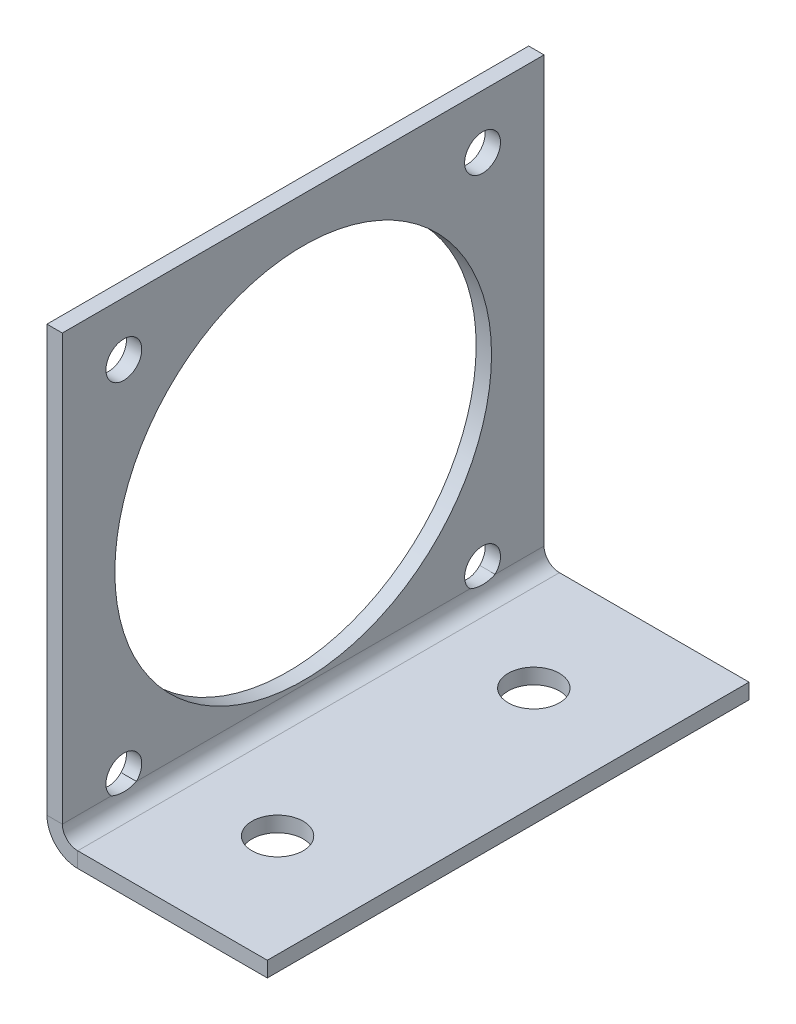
ISO-10303-21;
HEADER;
FILE_DESCRIPTION(('STEP AP214'),'2;1');
FILE_NAME('part.step','',(''),(''),'','','');
FILE_SCHEMA(('AUTOMOTIVE_DESIGN { 1 0 10303 214 1 1 1 1 }'));
ENDSEC;
DATA;
#1=APPLICATION_CONTEXT('core data for automotive mechanical design processes');
#2=APPLICATION_PROTOCOL_DEFINITION('international standard','automotive_design',2000,#1);
#3=PRODUCT_CONTEXT('',#1,'mechanical');
#4=PRODUCT('Part','Part','',(#3));
#5=PRODUCT_RELATED_PRODUCT_CATEGORY('part','',(#4));
#6=PRODUCT_DEFINITION_FORMATION('','',#4);
#7=PRODUCT_DEFINITION_CONTEXT('part definition',#1,'design');
#8=PRODUCT_DEFINITION('design','',#6,#7);
#9=PRODUCT_DEFINITION_SHAPE('','',#8);
#10=(LENGTH_UNIT() NAMED_UNIT(*) SI_UNIT(.MILLI.,.METRE.));
#11=(NAMED_UNIT(*) PLANE_ANGLE_UNIT() SI_UNIT($,.RADIAN.));
#12=(NAMED_UNIT(*) SI_UNIT($,.STERADIAN.) SOLID_ANGLE_UNIT());
#13=UNCERTAINTY_MEASURE_WITH_UNIT(LENGTH_MEASURE(1.E-05),#10,'distance_accuracy_value','');
#14=(GEOMETRIC_REPRESENTATION_CONTEXT(3) GLOBAL_UNCERTAINTY_ASSIGNED_CONTEXT((#13)) GLOBAL_UNIT_ASSIGNED_CONTEXT((#10,
#11,#12)) REPRESENTATION_CONTEXT('',''));
#15=CARTESIAN_POINT('',(0.,0.,0.));
#16=DIRECTION('',(0.,0.,1.));
#17=DIRECTION('',(1.,0.,0.));
#18=AXIS2_PLACEMENT_3D('',#15,#16,#17);
#19=CARTESIAN_POINT('',(3.,3.,94.));
#20=DIRECTION('',(0.,0.,-1.));
#21=DIRECTION('',(-1.,0.,0.));
#22=AXIS2_PLACEMENT_3D('',#19,#20,#21);
#23=CYLINDRICAL_SURFACE('',#22,3.);
#24=DIRECTION('',(0.,0.,-1.));
#25=VECTOR('',#24,1.);
#26=CARTESIAN_POINT('',(0.,3.,94.));
#27=LINE('',#26,#25);
#28=CARTESIAN_POINT('',(0.,3.,79.5505102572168));
#29=VERTEX_POINT('',#28);
#30=CARTESIAN_POINT('',(0.,3.,14.4494897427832));
#31=VERTEX_POINT('',#30);
#32=EDGE_CURVE('E145',#29,#31,#27,.T.);
#33=ORIENTED_EDGE('',*,*,#32,.F.);
#34=CARTESIAN_POINT('',(0.,3.,84.4494897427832));
#35=CARTESIAN_POINT('',(1.47979331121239E-06,2.98249898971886,84.4137569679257));
#36=CARTESIAN_POINT('',(0.000153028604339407,2.96562146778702,84.3777256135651));
#37=CARTESIAN_POINT('',(0.000702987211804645,2.93303032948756,84.3051495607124));
#38=CARTESIAN_POINT('',(0.00110135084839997,2.91731649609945,84.2686049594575));
#39=CARTESIAN_POINT('',(0.00258467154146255,2.8718541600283,84.1584705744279));
#40=CARTESIAN_POINT('',(0.00395834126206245,2.84370762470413,84.0842203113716));
#41=CARTESIAN_POINT('',(0.00715653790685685,2.79125126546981,83.9344449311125));
#42=CARTESIAN_POINT('',(0.00898082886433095,2.76693944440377,83.8589205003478));
#43=CARTESIAN_POINT('',(0.0128433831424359,2.72177370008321,83.7066410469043));
#44=CARTESIAN_POINT('',(0.0148821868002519,2.70092886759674,83.6298833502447));
#45=CARTESIAN_POINT('',(0.0189730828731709,2.66258306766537,83.4754946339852));
#46=CARTESIAN_POINT('',(0.0210251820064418,2.64508395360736,83.3978631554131));
#47=CARTESIAN_POINT('',(0.0249807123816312,2.6133270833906,83.2419102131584));
#48=CARTESIAN_POINT('',(0.0268840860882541,2.59907057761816,83.1635884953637));
#49=CARTESIAN_POINT('',(0.0314851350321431,2.56601293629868,82.9600642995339));
#50=CARTESIAN_POINT('',(0.0339883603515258,2.549497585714,82.8344823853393));
#51=CARTESIAN_POINT('',(0.0380592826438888,2.52347444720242,82.5825721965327));
#52=CARTESIAN_POINT('',(0.0396268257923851,2.51396781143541,82.4562438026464));
#53=CARTESIAN_POINT('',(0.0416374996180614,2.50187365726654,82.203218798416));
#54=CARTESIAN_POINT('',(0.042080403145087,2.49928753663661,82.0765221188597));
#55=CARTESIAN_POINT('',(0.0417783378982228,2.50107622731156,81.8232267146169));
#56=CARTESIAN_POINT('',(0.0410338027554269,2.5054484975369,81.6966279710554));
#57=CARTESIAN_POINT('',(0.0384617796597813,2.52108992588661,81.4438948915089));
#58=CARTESIAN_POINT('',(0.0366345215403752,2.53235762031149,81.3177604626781));
#59=CARTESIAN_POINT('',(0.0320847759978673,2.56215398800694,81.0663767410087));
#60=CARTESIAN_POINT('',(0.0293624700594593,2.58068118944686,80.9411272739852));
#61=CARTESIAN_POINT('',(0.0246293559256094,2.61615041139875,80.7437302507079));
#62=CARTESIAN_POINT('',(0.0227921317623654,2.63055937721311,80.6711167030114));
#63=CARTESIAN_POINT('',(0.0190394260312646,2.66217206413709,80.526525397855));
#64=CARTESIAN_POINT('',(0.017123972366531,2.67937479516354,80.4545474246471));
#65=CARTESIAN_POINT('',(0.01335031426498,2.71666928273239,80.3113813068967));
#66=CARTESIAN_POINT('',(0.0114920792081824,2.73675946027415,80.2401927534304));
#67=CARTESIAN_POINT('',(0.00799354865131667,2.78007612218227,80.0989137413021));
#68=CARTESIAN_POINT('',(0.00635284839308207,2.80329661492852,80.0288214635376));
#69=CARTESIAN_POINT('',(0.0034902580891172,2.85316241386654,79.8898071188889));
#70=CARTESIAN_POINT('',(0.00226857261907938,2.87980938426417,79.8208856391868));
#71=CARTESIAN_POINT('',(0.000530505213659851,2.93693941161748,79.6844838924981));
#72=CARTESIAN_POINT('',(1.55527818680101E-05,2.9674301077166,79.6170068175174));
#73=CARTESIAN_POINT('',(0.,3.,79.5505102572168));
#74=B_SPLINE_CURVE_WITH_KNOTS('',3,(#34,#35,#36,#37,#38,#39,#40,#41,#42,#43,#44,#45,#46,#47,#48,
#49,#50,#51,#52,#53,#54,#55,#56,#57,#58,#59,#60,#61,#62,#63,#64,#65,#66,#67,#68,#69,#70,#71,#72,
#73),.UNSPECIFIED.,.F.,.F.,(4,2,2,2,2,2,2,2,2,2,2,2,2,2,2,2,2,2,2,4),(0.,0.119349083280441,
0.238675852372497,0.476797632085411,0.714794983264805,0.953406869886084,1.19215055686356,
1.43098615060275,1.81082082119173,2.19071791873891,2.57069174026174,2.95052683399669,
3.3302813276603,3.70995886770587,3.93206864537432,4.15409988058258,4.37601015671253,
4.59750155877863,4.81910094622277,5.04114790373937),.UNSPECIFIED.);
#75=CARTESIAN_POINT('',(0.,3.,84.4494897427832));
#76=VERTEX_POINT('',#75);
#77=EDGE_CURVE('E53',#76,#29,#74,.T.);
#78=ORIENTED_EDGE('',*,*,#77,.F.);
#79=CARTESIAN_POINT('',(0.,3.,94.));
#80=VERTEX_POINT('',#79);
#81=EDGE_CURVE('E142',#80,#76,#27,.T.);
#82=ORIENTED_EDGE('',*,*,#81,.F.);
#83=CARTESIAN_POINT('',(3.,3.,94.));
#84=DIRECTION('',(0.,0.,-1.));
#85=DIRECTION('',(-1.,0.,0.));
#86=AXIS2_PLACEMENT_3D('',#83,#84,#85);
#87=CIRCLE('',#86,3.);
#88=CARTESIAN_POINT('',(3.,0.,94.));
#89=VERTEX_POINT('',#88);
#90=EDGE_CURVE('E212',#80,#89,#87,.F.);
#91=ORIENTED_EDGE('',*,*,#90,.T.);
#92=DIRECTION('',(0.,0.,-1.));
#93=VECTOR('',#92,1.);
#94=CARTESIAN_POINT('',(3.,0.,94.));
#95=LINE('',#94,#93);
#96=CARTESIAN_POINT('',(3.,0.,0.));
#97=VERTEX_POINT('',#96);
#98=EDGE_CURVE('E151',#89,#97,#95,.T.);
#99=ORIENTED_EDGE('',*,*,#98,.T.);
#100=CARTESIAN_POINT('',(3.,3.,0.));
#101=DIRECTION('',(0.,0.,-1.));
#102=DIRECTION('',(-1.,0.,0.));
#103=AXIS2_PLACEMENT_3D('',#100,#101,#102);
#104=CIRCLE('',#103,3.);
#105=CARTESIAN_POINT('',(0.,3.,0.));
#106=VERTEX_POINT('',#105);
#107=EDGE_CURVE('E191',#106,#97,#104,.F.);
#108=ORIENTED_EDGE('',*,*,#107,.F.);
#109=CARTESIAN_POINT('',(0.,3.,9.55051025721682));
#110=VERTEX_POINT('',#109);
#111=EDGE_CURVE('E153',#110,#106,#27,.T.);
#112=ORIENTED_EDGE('',*,*,#111,.F.);
#113=CARTESIAN_POINT('',(0.,3.,14.4494897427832));
#114=CARTESIAN_POINT('',(2.32538618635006E-05,2.96358321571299,14.3751180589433));
#115=CARTESIAN_POINT('',(0.000663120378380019,2.92975707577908,14.2995332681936));
#116=CARTESIAN_POINT('',(0.0027845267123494,2.86687205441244,14.1466211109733));
#117=CARTESIAN_POINT('',(0.00426405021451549,2.83780196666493,14.0692983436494));
#118=CARTESIAN_POINT('',(0.00767612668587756,2.78386013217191,13.9132755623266));
#119=CARTESIAN_POINT('',(0.00960843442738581,2.75898612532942,13.8345763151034));
#120=CARTESIAN_POINT('',(0.0136706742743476,2.71299171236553,13.6758507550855));
#121=CARTESIAN_POINT('',(0.0158011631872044,2.69188239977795,13.5958212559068));
#122=CARTESIAN_POINT('',(0.0200474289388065,2.65321456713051,13.4348597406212));
#123=CARTESIAN_POINT('',(0.022163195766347,2.63565827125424,13.3539271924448));
#124=CARTESIAN_POINT('',(0.0262192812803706,2.60391496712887,13.1913740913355));
#125=CARTESIAN_POINT('',(0.0281595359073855,2.58972918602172,13.1097532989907));
#126=CARTESIAN_POINT('',(0.0326844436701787,2.55793612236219,12.902830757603));
#127=CARTESIAN_POINT('',(0.0350693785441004,2.54246922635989,12.7771912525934));
#128=CARTESIAN_POINT('',(0.0388441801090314,2.5186487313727,12.5252290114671));
#129=CARTESIAN_POINT('',(0.0402339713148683,2.5102956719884,12.3989062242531));
#130=CARTESIAN_POINT('',(0.041885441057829,2.50041703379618,12.1459587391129));
#131=CARTESIAN_POINT('',(0.0421468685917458,2.49889297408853,12.0193339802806));
#132=CARTESIAN_POINT('',(0.0414977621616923,2.50273878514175,11.7662849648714));
#133=CARTESIAN_POINT('',(0.040588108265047,2.50810347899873,11.639860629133));
#134=CARTESIAN_POINT('',(0.037697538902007,2.5258224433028,11.3875422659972));
#135=CARTESIAN_POINT('',(0.0357168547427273,2.53817520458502,11.2616481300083));
#136=CARTESIAN_POINT('',(0.0309146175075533,2.5701197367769,11.0108150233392));
#137=CARTESIAN_POINT('',(0.0280932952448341,2.58970952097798,10.885875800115));
#138=CARTESIAN_POINT('',(0.0233282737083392,2.62637164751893,10.6920187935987));
#139=CARTESIAN_POINT('',(0.0215430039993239,2.64077398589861,10.6225852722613));
#140=CARTESIAN_POINT('',(0.0179216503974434,2.6721900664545,10.4843340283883));
#141=CARTESIAN_POINT('',(0.0160855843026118,2.68920290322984,10.4155161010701));
#142=CARTESIAN_POINT('',(0.0124873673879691,2.72593898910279,10.278639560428));
#143=CARTESIAN_POINT('',(0.010725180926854,2.74566091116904,10.2105805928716));
#144=CARTESIAN_POINT('',(0.00742717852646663,2.78797141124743,10.0754705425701));
#145=CARTESIAN_POINT('',(0.0058910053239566,2.81055535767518,10.0084180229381));
#146=CARTESIAN_POINT('',(0.00322306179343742,2.8588606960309,9.8753996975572));
#147=CARTESIAN_POINT('',(0.00209147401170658,2.88458349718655,9.80943439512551));
#148=CARTESIAN_POINT('',(0.000486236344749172,2.93955916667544,9.67884556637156));
#149=CARTESIAN_POINT('',(1.37985546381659E-05,2.96881843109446,9.61422472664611));
#150=CARTESIAN_POINT('',(0.,3.,9.55051025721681));
#151=B_SPLINE_CURVE_WITH_KNOTS('',3,(#113,#114,#115,#116,#117,#118,#119,#120,#121,#122,#123,
#124,#125,#126,#127,#128,#129,#130,#131,#132,#133,#134,#135,#136,#137,#138,#139,#140,#141,#142,
#143,#144,#145,#146,#147,#148,#149,#150),.UNSPECIFIED.,.F.,.F.,(4,2,2,2,2,2,2,2,2,2,2,2,2,2,2,2,
2,2,4),(0.,0.248303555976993,0.496013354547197,0.743589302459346,0.991883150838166,
1.24033195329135,1.48887107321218,1.86847035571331,2.2480984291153,2.62781094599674,
3.00723827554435,3.38658369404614,3.76582505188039,3.97858466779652,4.19127065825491,
4.40385283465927,4.61609528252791,4.82843337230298,5.04116141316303),.UNSPECIFIED.);
#152=EDGE_CURVE('E246',#31,#110,#151,.T.);
#153=ORIENTED_EDGE('',*,*,#152,.F.);
#154=EDGE_LOOP('',(#33,#78,#82,#91,#99,#108,#112,#153));
#155=FACE_BOUND('',#154,.T.);
#156=ADVANCED_FACE('F38',(#155),#23,.F.);
#157=CARTESIAN_POINT('',(0.,86.,94.));
#158=DIRECTION('',(1.,0.,0.));
#159=DIRECTION('',(0.,1.,0.));
#160=AXIS2_PLACEMENT_3D('',#157,#158,#159);
#161=PLANE('',#160);
#162=CARTESIAN_POINT('',(0.,75.5,82.));
#163=DIRECTION('',(-1.,0.,0.));
#164=DIRECTION('',(0.,0.,1.));
#165=AXIS2_PLACEMENT_3D('',#162,#163,#164);
#166=CIRCLE('',#165,3.50000000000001);
#167=CARTESIAN_POINT('',(0.,75.5,85.5));
#168=VERTEX_POINT('',#167);
#169=EDGE_CURVE('E233',#168,#168,#166,.T.);
#170=ORIENTED_EDGE('',*,*,#169,.T.);
#171=EDGE_LOOP('',(#170));
#172=FACE_BOUND('',#171,.T.);
#173=CARTESIAN_POINT('',(0.,75.5,12.));
#174=DIRECTION('',(-1.,0.,0.));
#175=DIRECTION('',(0.,0.,1.));
#176=AXIS2_PLACEMENT_3D('',#173,#174,#175);
#177=CIRCLE('',#176,3.50000000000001);
#178=CARTESIAN_POINT('',(0.,75.5,15.5));
#179=VERTEX_POINT('',#178);
#180=EDGE_CURVE('E227',#179,#179,#177,.T.);
#181=ORIENTED_EDGE('',*,*,#180,.T.);
#182=EDGE_LOOP('',(#181));
#183=FACE_BOUND('',#182,.T.);
#184=CARTESIAN_POINT('',(0.,40.5,47.));
#185=DIRECTION('',(-1.,0.,0.));
#186=DIRECTION('',(0.,0.,1.));
#187=AXIS2_PLACEMENT_3D('',#184,#185,#186);
#188=CIRCLE('',#187,36.75);
#189=CARTESIAN_POINT('',(0.,40.5,83.75));
#190=VERTEX_POINT('',#189);
#191=EDGE_CURVE('E221',#190,#190,#188,.T.);
#192=ORIENTED_EDGE('',*,*,#191,.T.);
#193=EDGE_LOOP('',(#192));
#194=FACE_BOUND('',#193,.T.);
#195=ORIENTED_EDGE('',*,*,#81,.T.);
#196=CARTESIAN_POINT('',(0.,5.5,82.));
#197=DIRECTION('',(-1.,0.,0.));
#198=DIRECTION('',(0.,0.,1.));
#199=AXIS2_PLACEMENT_3D('',#196,#197,#198);
#200=CIRCLE('',#199,3.50000000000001);
#201=EDGE_CURVE('E125',#76,#29,#200,.T.);
#202=ORIENTED_EDGE('',*,*,#201,.T.);
#203=ORIENTED_EDGE('',*,*,#32,.T.);
#204=CARTESIAN_POINT('',(0.,5.5,12.));
#205=DIRECTION('',(-1.,0.,0.));
#206=DIRECTION('',(0.,0.,1.));
#207=AXIS2_PLACEMENT_3D('',#204,#205,#206);
#208=CIRCLE('',#207,3.5);
#209=EDGE_CURVE('E244',#31,#110,#208,.T.);
#210=ORIENTED_EDGE('',*,*,#209,.T.);
#211=ORIENTED_EDGE('',*,*,#111,.T.);
#212=DIRECTION('',(0.,-1.,0.));
#213=VECTOR('',#212,1.);
#214=CARTESIAN_POINT('',(0.,86.,0.));
#215=LINE('',#214,#213);
#216=CARTESIAN_POINT('',(0.,86.,0.));
#217=VERTEX_POINT('',#216);
#218=EDGE_CURVE('E188',#217,#106,#215,.T.);
#219=ORIENTED_EDGE('',*,*,#218,.F.);
#220=DIRECTION('',(0.,0.,-1.));
#221=VECTOR('',#220,1.);
#222=CARTESIAN_POINT('',(0.,86.,94.));
#223=LINE('',#222,#221);
#224=CARTESIAN_POINT('',(0.,86.,94.));
#225=VERTEX_POINT('',#224);
#226=EDGE_CURVE('E158',#225,#217,#223,.T.);
#227=ORIENTED_EDGE('',*,*,#226,.F.);
#228=DIRECTION('',(0.,-1.,0.));
#229=VECTOR('',#228,1.);
#230=CARTESIAN_POINT('',(0.,86.,94.));
#231=LINE('',#230,#229);
#232=EDGE_CURVE('E150',#225,#80,#231,.T.);
#233=ORIENTED_EDGE('',*,*,#232,.T.);
#234=EDGE_LOOP('',(#195,#202,#203,#210,#211,#219,#227,#233));
#235=FACE_BOUND('',#234,.T.);
#236=ADVANCED_FACE('F148',(#172,#183,#194,#235),#161,.T.);
#237=CARTESIAN_POINT('',(-3.,86.,94.));
#238=DIRECTION('',(1.,0.,0.));
#239=DIRECTION('',(0.,1.,0.));
#240=AXIS2_PLACEMENT_3D('',#237,#238,#239);
#241=PLANE('',#240);
#242=CARTESIAN_POINT('',(-3.,75.5,82.));
#243=DIRECTION('',(-1.,0.,0.));
#244=DIRECTION('',(0.,0.,1.));
#245=AXIS2_PLACEMENT_3D('',#242,#243,#244);
#246=CIRCLE('',#245,3.50000000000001);
#247=CARTESIAN_POINT('',(-3.,75.5,85.5));
#248=VERTEX_POINT('',#247);
#249=EDGE_CURVE('E230',#248,#248,#246,.T.);
#250=ORIENTED_EDGE('',*,*,#249,.F.);
#251=EDGE_LOOP('',(#250));
#252=FACE_BOUND('',#251,.T.);
#253=CARTESIAN_POINT('',(-3.,75.5,12.));
#254=DIRECTION('',(-1.,0.,0.));
#255=DIRECTION('',(0.,0.,1.));
#256=AXIS2_PLACEMENT_3D('',#253,#254,#255);
#257=CIRCLE('',#256,3.50000000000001);
#258=CARTESIAN_POINT('',(-3.,75.5,15.5));
#259=VERTEX_POINT('',#258);
#260=EDGE_CURVE('E224',#259,#259,#257,.T.);
#261=ORIENTED_EDGE('',*,*,#260,.F.);
#262=EDGE_LOOP('',(#261));
#263=FACE_BOUND('',#262,.T.);
#264=CARTESIAN_POINT('',(-3.,40.5,47.));
#265=DIRECTION('',(-1.,0.,0.));
#266=DIRECTION('',(0.,0.,1.));
#267=AXIS2_PLACEMENT_3D('',#264,#265,#266);
#268=CIRCLE('',#267,36.75);
#269=CARTESIAN_POINT('',(-3.,40.5,83.75));
#270=VERTEX_POINT('',#269);
#271=EDGE_CURVE('E203',#270,#270,#268,.T.);
#272=ORIENTED_EDGE('',*,*,#271,.F.);
#273=EDGE_LOOP('',(#272));
#274=FACE_BOUND('',#273,.T.);
#275=CARTESIAN_POINT('',(-3.,5.5,82.));
#276=DIRECTION('',(-1.,0.,0.));
#277=DIRECTION('',(0.,0.,1.));
#278=AXIS2_PLACEMENT_3D('',#275,#276,#277);
#279=CIRCLE('',#278,3.50000000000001);
#280=CARTESIAN_POINT('',(-3.,3.00000000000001,84.4494897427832));
#281=VERTEX_POINT('',#280);
#282=CARTESIAN_POINT('',(-3.,3.,79.5505102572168));
#283=VERTEX_POINT('',#282);
#284=EDGE_CURVE('E132',#281,#283,#279,.T.);
#285=ORIENTED_EDGE('',*,*,#284,.F.);
#286=DIRECTION('',(0.,0.,-1.));
#287=VECTOR('',#286,1.);
#288=CARTESIAN_POINT('',(-3.,3.,94.));
#289=LINE('',#288,#287);
#290=CARTESIAN_POINT('',(-3.,3.,94.));
#291=VERTEX_POINT('',#290);
#292=EDGE_CURVE('E167',#291,#281,#289,.T.);
#293=ORIENTED_EDGE('',*,*,#292,.F.);
#294=DIRECTION('',(0.,-1.,0.));
#295=VECTOR('',#294,1.);
#296=CARTESIAN_POINT('',(-3.,86.,94.));
#297=LINE('',#296,#295);
#298=CARTESIAN_POINT('',(-3.,86.,94.));
#299=VERTEX_POINT('',#298);
#300=EDGE_CURVE('E206',#299,#291,#297,.T.);
#301=ORIENTED_EDGE('',*,*,#300,.F.);
#302=DIRECTION('',(0.,0.,-1.));
#303=VECTOR('',#302,1.);
#304=CARTESIAN_POINT('',(-3.,86.,94.));
#305=LINE('',#304,#303);
#306=CARTESIAN_POINT('',(-3.,86.,0.));
#307=VERTEX_POINT('',#306);
#308=EDGE_CURVE('E163',#299,#307,#305,.T.);
#309=ORIENTED_EDGE('',*,*,#308,.T.);
#310=DIRECTION('',(0.,-1.,0.));
#311=VECTOR('',#310,1.);
#312=CARTESIAN_POINT('',(-3.,86.,0.));
#313=LINE('',#312,#311);
#314=CARTESIAN_POINT('',(-3.,3.,0.));
#315=VERTEX_POINT('',#314);
#316=EDGE_CURVE('E182',#307,#315,#313,.T.);
#317=ORIENTED_EDGE('',*,*,#316,.T.);
#318=CARTESIAN_POINT('',(-3.,3.,9.55051025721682));
#319=VERTEX_POINT('',#318);
#320=EDGE_CURVE('E173',#319,#315,#289,.T.);
#321=ORIENTED_EDGE('',*,*,#320,.F.);
#322=CARTESIAN_POINT('',(-3.,5.5,12.));
#323=DIRECTION('',(-1.,0.,0.));
#324=DIRECTION('',(0.,0.,1.));
#325=AXIS2_PLACEMENT_3D('',#322,#323,#324);
#326=CIRCLE('',#325,3.5);
#327=CARTESIAN_POINT('',(-3.,3.00000000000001,14.4494897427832));
#328=VERTEX_POINT('',#327);
#329=EDGE_CURVE('E241',#328,#319,#326,.T.);
#330=ORIENTED_EDGE('',*,*,#329,.F.);
#331=EDGE_CURVE('E172',#283,#328,#289,.T.);
#332=ORIENTED_EDGE('',*,*,#331,.F.);
#333=EDGE_LOOP('',(#285,#293,#301,#309,#317,#321,#330,#332));
#334=FACE_BOUND('',#333,.T.);
#335=ADVANCED_FACE('F303',(#252,#263,#274,#334),#241,.F.);
#336=CARTESIAN_POINT('',(3.,3.,94.));
#337=DIRECTION('',(0.,0.,-1.));
#338=DIRECTION('',(-1.,0.,0.));
#339=AXIS2_PLACEMENT_3D('',#336,#337,#338);
#340=CYLINDRICAL_SURFACE('',#339,6.);
#341=CARTESIAN_POINT('',(-3.,3.00000000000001,84.4494897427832));
#342=CARTESIAN_POINT('',(-2.99999529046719,2.93163605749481,84.3796906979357));
#343=CARTESIAN_POINT('',(-2.99883128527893,2.86629022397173,84.3069761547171));
#344=CARTESIAN_POINT('',(-2.9947713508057,2.74192436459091,84.1563611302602));
#345=CARTESIAN_POINT('',(-2.99187537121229,2.68290452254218,84.0784604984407));
#346=CARTESIAN_POINT('',(-2.98494084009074,2.57152626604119,83.9181829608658));
#347=CARTESIAN_POINT('',(-2.98090315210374,2.51916286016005,83.8358094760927));
#348=CARTESIAN_POINT('',(-2.97223865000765,2.42140282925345,83.6670462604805));
#349=CARTESIAN_POINT('',(-2.96761187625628,2.37600572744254,83.5806568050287));
#350=CARTESIAN_POINT('',(-2.96063214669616,2.31348456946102,83.4484468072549));
#351=CARTESIAN_POINT('',(-2.95829837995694,2.29356893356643,83.4039275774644));
#352=CARTESIAN_POINT('',(-2.95368304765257,2.25567317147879,83.3140702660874));
#353=CARTESIAN_POINT('',(-2.95140148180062,2.23769303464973,83.2687321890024));
#354=CARTESIAN_POINT('',(-2.94471784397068,2.18666589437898,83.131625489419));
#355=CARTESIAN_POINT('',(-2.94047603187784,2.1565253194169,83.038749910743));
#356=CARTESIAN_POINT('',(-2.93278735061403,2.10404470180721,82.8508393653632));
#357=CARTESIAN_POINT('',(-2.92934020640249,2.08170195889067,82.755805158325));
#358=CARTESIAN_POINT('',(-2.92352300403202,2.0448963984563,82.5641898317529));
#359=CARTESIAN_POINT('',(-2.92115291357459,2.03043334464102,82.4676087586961));
#360=CARTESIAN_POINT('',(-2.91768767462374,2.0095019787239,82.2730576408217));
#361=CARTESIAN_POINT('',(-2.91659905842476,2.00307461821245,82.1750830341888));
#362=CARTESIAN_POINT('',(-2.91585475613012,1.99866695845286,81.9789384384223));
#363=CARTESIAN_POINT('',(-2.91619907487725,2.00068668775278,81.8807684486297));
#364=CARTESIAN_POINT('',(-2.91824850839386,2.01289684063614,81.6849358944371));
#365=CARTESIAN_POINT('',(-2.919953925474,2.02308907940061,81.5872734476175));
#366=CARTESIAN_POINT('',(-2.92459309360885,2.05163018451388,81.3931756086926));
#367=CARTESIAN_POINT('',(-2.92752683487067,2.06997898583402,81.296740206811));
#368=CARTESIAN_POINT('',(-2.93433170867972,2.11444617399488,81.1069163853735));
#369=CARTESIAN_POINT('',(-2.93819136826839,2.14047029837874,81.013505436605));
#370=CARTESIAN_POINT('',(-2.94652802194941,2.20017892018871,80.8291876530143));
#371=CARTESIAN_POINT('',(-2.95100504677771,2.233863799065,80.7382809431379));
#372=CARTESIAN_POINT('',(-2.96015821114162,2.30867613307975,80.5596582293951));
#373=CARTESIAN_POINT('',(-2.96483422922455,2.34979909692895,80.4719403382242));
#374=CARTESIAN_POINT('',(-2.97389085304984,2.43906779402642,80.3001784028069));
#375=CARTESIAN_POINT('',(-2.97827152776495,2.48721187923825,80.2161335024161));
#376=CARTESIAN_POINT('',(-2.98735057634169,2.60498896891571,80.0290784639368));
#377=CARTESIAN_POINT('',(-2.99178769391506,2.67684666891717,79.9274364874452));
#378=CARTESIAN_POINT('',(-2.99653068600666,2.79238698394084,79.781228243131));
#379=CARTESIAN_POINT('',(-2.99779274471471,2.83217030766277,79.7335574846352));
#380=CARTESIAN_POINT('',(-2.99952741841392,2.91423769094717,79.640378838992));
#381=CARTESIAN_POINT('',(-2.99999979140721,2.95652251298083,79.5948716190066));
#382=CARTESIAN_POINT('',(-3.,3.,79.5505102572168));
#383=B_SPLINE_CURVE_WITH_KNOTS('',3,(#341,#342,#343,#344,#345,#346,#347,#348,#349,#350,#351,
#352,#353,#354,#355,#356,#357,#358,#359,#360,#361,#362,#363,#364,#365,#366,#367,#368,#369,#370,
#371,#372,#373,#374,#375,#376,#377,#378,#379,#380,#381,#382),.UNSPECIFIED.,.F.,.F.,(4,2,2,2,2,2,
2,2,2,2,2,2,2,2,2,2,2,2,2,2,4),(0.,0.292966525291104,0.585941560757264,0.878695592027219,
1.17142957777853,1.31787068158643,1.46431098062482,1.75714361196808,2.04987473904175,
2.34259708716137,2.63680520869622,2.93101432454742,3.22528880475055,3.51956093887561,
3.81035971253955,4.10117296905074,4.39181120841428,4.68238133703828,5.0552259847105,
5.24145720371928,5.42774548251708),.UNSPECIFIED.);
#384=EDGE_CURVE('E136',#281,#283,#383,.T.);
#385=ORIENTED_EDGE('',*,*,#384,.T.);
#386=ORIENTED_EDGE('',*,*,#331,.T.);
#387=CARTESIAN_POINT('',(-3.,3.00000000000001,14.4494897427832));
#388=CARTESIAN_POINT('',(-2.99999829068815,2.93141112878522,14.3795418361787));
#389=CARTESIAN_POINT('',(-2.99882367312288,2.86579704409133,14.3066987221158));
#390=CARTESIAN_POINT('',(-2.99473117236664,2.74095726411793,14.1558098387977));
#391=CARTESIAN_POINT('',(-2.99181381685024,2.68172964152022,14.0777656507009));
#392=CARTESIAN_POINT('',(-2.98483967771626,2.5700918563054,13.9170658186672));
#393=CARTESIAN_POINT('',(-2.98078355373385,2.51767777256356,13.8344128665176));
#394=CARTESIAN_POINT('',(-2.97209605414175,2.41993384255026,13.6650401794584));
#395=CARTESIAN_POINT('',(-2.96746463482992,2.37460453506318,13.5783201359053));
#396=CARTESIAN_POINT('',(-2.95815159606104,2.29134992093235,13.401403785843));
#397=CARTESIAN_POINT('',(-2.95346997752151,2.25342447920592,13.3112075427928));
#398=CARTESIAN_POINT('',(-2.94452452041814,2.18525334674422,13.1279233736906));
#399=CARTESIAN_POINT('',(-2.94026067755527,2.15500757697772,13.0348354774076));
#400=CARTESIAN_POINT('',(-2.93447658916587,2.1156008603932,12.8935519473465));
#401=CARTESIAN_POINT('',(-2.93265049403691,2.10345887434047,12.8461817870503));
#402=CARTESIAN_POINT('',(-2.92923752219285,2.08115888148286,12.7509807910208));
#403=CARTESIAN_POINT('',(-2.92765058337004,2.07100035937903,12.7031500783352));
#404=CARTESIAN_POINT('',(-2.9233104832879,2.04357788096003,12.5590518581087));
#405=CARTESIAN_POINT('',(-2.92097785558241,2.02936580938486,12.4621739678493));
#406=CARTESIAN_POINT('',(-2.91759609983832,2.00895972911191,12.2673978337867));
#407=CARTESIAN_POINT('',(-2.91654920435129,2.00277966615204,12.1694981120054));
#408=CARTESIAN_POINT('',(-2.91586198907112,1.99870954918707,11.9735192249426));
#409=CARTESIAN_POINT('',(-2.9162216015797,2.00081909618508,11.8754400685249));
#410=CARTESIAN_POINT('',(-2.91831087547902,2.01327026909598,11.6797975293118));
#411=CARTESIAN_POINT('',(-2.92004089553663,2.02361405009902,11.5822342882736));
#412=CARTESIAN_POINT('',(-2.92472567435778,2.05245640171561,11.3883483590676));
#413=CARTESIAN_POINT('',(-2.92768047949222,2.07095528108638,11.2920257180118));
#414=CARTESIAN_POINT('',(-2.93453053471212,2.1157742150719,11.102119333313));
#415=CARTESIAN_POINT('',(-2.93841751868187,2.1420259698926,11.0085192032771));
#416=CARTESIAN_POINT('',(-2.9467920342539,2.20213771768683,10.8238526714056));
#417=CARTESIAN_POINT('',(-2.95127956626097,2.23599771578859,10.7327862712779));
#418=CARTESIAN_POINT('',(-2.96504937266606,2.34888405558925,10.4644932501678));
#419=CARTESIAN_POINT('',(-2.97465155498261,2.43928515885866,10.2918811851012));
#420=CARTESIAN_POINT('',(-2.98760489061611,2.60893344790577,10.023990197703));
#421=CARTESIAN_POINT('',(-2.99195758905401,2.68014884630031,9.92353364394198));
#422=CARTESIAN_POINT('',(-2.99814855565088,2.83266050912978,9.73073145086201));
#423=CARTESIAN_POINT('',(-2.99999016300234,2.91394322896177,9.63837519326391));
#424=CARTESIAN_POINT('',(-3.,3.00000000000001,9.55051025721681));
#425=B_SPLINE_CURVE_WITH_KNOTS('',3,(#387,#388,#389,#390,#391,#392,#393,#394,#395,#396,#397,
#398,#399,#400,#401,#402,#403,#404,#405,#406,#407,#408,#409,#410,#411,#412,#413,#414,#415,#416,
#417,#418,#419,#420,#421,#422,#423,#424),.UNSPECIFIED.,.F.,.F.,(4,2,2,2,2,2,2,2,2,2,2,2,2,2,2,2,
2,2,4),(0.,0.293779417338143,0.587469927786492,0.880990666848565,1.17453371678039,
1.46807141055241,1.76160608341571,1.908375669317,2.0551070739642,2.34855651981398,
2.64251479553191,2.93645892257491,3.23048000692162,3.52451222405,3.81602770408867,
4.10754338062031,4.68968636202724,5.05871898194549,5.42726039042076),.UNSPECIFIED.);
#426=EDGE_CURVE('E137',#328,#319,#425,.T.);
#427=ORIENTED_EDGE('',*,*,#426,.T.);
#428=ORIENTED_EDGE('',*,*,#320,.T.);
#429=CARTESIAN_POINT('',(3.,3.,0.));
#430=DIRECTION('',(0.,0.,1.));
#431=DIRECTION('',(1.,0.,0.));
#432=AXIS2_PLACEMENT_3D('',#429,#430,#431);
#433=CIRCLE('',#432,6.);
#434=CARTESIAN_POINT('',(3.,-3.,0.));
#435=VERTEX_POINT('',#434);
#436=EDGE_CURVE('E178',#315,#435,#433,.T.);
#437=ORIENTED_EDGE('',*,*,#436,.T.);
#438=DIRECTION('',(0.,0.,-1.));
#439=VECTOR('',#438,1.);
#440=CARTESIAN_POINT('',(3.,-3.,94.));
#441=LINE('',#440,#439);
#442=CARTESIAN_POINT('',(3.,-3.,94.));
#443=VERTEX_POINT('',#442);
#444=EDGE_CURVE('E174',#443,#435,#441,.T.);
#445=ORIENTED_EDGE('',*,*,#444,.F.);
#446=CARTESIAN_POINT('',(3.,3.,94.));
#447=DIRECTION('',(0.,0.,1.));
#448=DIRECTION('',(1.,0.,0.));
#449=AXIS2_PLACEMENT_3D('',#446,#447,#448);
#450=CIRCLE('',#449,6.);
#451=EDGE_CURVE('E177',#291,#443,#450,.T.);
#452=ORIENTED_EDGE('',*,*,#451,.F.);
#453=ORIENTED_EDGE('',*,*,#292,.T.);
#454=EDGE_LOOP('',(#385,#386,#427,#428,#437,#445,#452,#453));
#455=FACE_BOUND('',#454,.T.);
#456=ADVANCED_FACE('F299',(#455),#340,.T.);
#457=CARTESIAN_POINT('',(3.,0.,94.));
#458=DIRECTION('',(0.,0.,1.));
#459=DIRECTION('',(1.,0.,0.));
#460=AXIS2_PLACEMENT_3D('',#457,#458,#459);
#461=PLANE('',#460);
#462=DIRECTION('',(0.,-1.,0.));
#463=VECTOR('',#462,1.);
#464=CARTESIAN_POINT('',(3.,0.,94.));
#465=LINE('',#464,#463);
#466=EDGE_CURVE('E11',#89,#443,#465,.T.);
#467=ORIENTED_EDGE('',*,*,#466,.F.);
#468=ORIENTED_EDGE('',*,*,#90,.F.);
#469=DIRECTION('',(1.,0.,0.));
#470=VECTOR('',#469,1.);
#471=CARTESIAN_POINT('',(-3.,3.,94.));
#472=LINE('',#471,#470);
#473=EDGE_CURVE('E46',#291,#80,#472,.T.);
#474=ORIENTED_EDGE('',*,*,#473,.F.);
#475=ORIENTED_EDGE('',*,*,#451,.T.);
#476=EDGE_LOOP('',(#467,#468,#474,#475));
#477=FACE_BOUND('',#476,.T.);
#478=ADVANCED_FACE('F40',(#477),#461,.T.);
#479=CARTESIAN_POINT('',(-3.,3.,94.));
#480=DIRECTION('',(0.,0.,1.));
#481=DIRECTION('',(1.,0.,0.));
#482=AXIS2_PLACEMENT_3D('',#479,#480,#481);
#483=PLANE('',#482);
#484=DIRECTION('',(1.,0.,0.));
#485=VECTOR('',#484,1.);
#486=CARTESIAN_POINT('',(0.,0.,94.));
#487=LINE('',#486,#485);
#488=CARTESIAN_POINT('',(40.,0.,94.));
#489=VERTEX_POINT('',#488);
#490=EDGE_CURVE('E214',#89,#489,#487,.T.);
#491=ORIENTED_EDGE('',*,*,#490,.F.);
#492=ORIENTED_EDGE('',*,*,#466,.T.);
#493=DIRECTION('',(1.,0.,0.));
#494=VECTOR('',#493,1.);
#495=CARTESIAN_POINT('',(0.,-3.,94.));
#496=LINE('',#495,#494);
#497=CARTESIAN_POINT('',(40.,-3.,94.));
#498=VERTEX_POINT('',#497);
#499=EDGE_CURVE('E181',#443,#498,#496,.T.);
#500=ORIENTED_EDGE('',*,*,#499,.T.);
#501=DIRECTION('',(0.,-1.,0.));
#502=VECTOR('',#501,1.);
#503=CARTESIAN_POINT('',(40.,0.,94.));
#504=LINE('',#503,#502);
#505=EDGE_CURVE('E217',#489,#498,#504,.T.);
#506=ORIENTED_EDGE('',*,*,#505,.F.);
#507=EDGE_LOOP('',(#491,#492,#500,#506));
#508=FACE_BOUND('',#507,.T.);
#509=ADVANCED_FACE('F343',(#508),#483,.T.);
#510=CARTESIAN_POINT('',(0.,3.,0.));
#511=DIRECTION('',(0.,0.,-1.));
#512=DIRECTION('',(-1.,0.,0.));
#513=AXIS2_PLACEMENT_3D('',#510,#511,#512);
#514=PLANE('',#513);
#515=DIRECTION('',(-1.,0.,0.));
#516=VECTOR('',#515,1.);
#517=CARTESIAN_POINT('',(0.,3.,0.));
#518=LINE('',#517,#516);
#519=EDGE_CURVE('E310',#106,#315,#518,.T.);
#520=ORIENTED_EDGE('',*,*,#519,.F.);
#521=ORIENTED_EDGE('',*,*,#107,.T.);
#522=DIRECTION('',(0.,1.,0.));
#523=VECTOR('',#522,1.);
#524=CARTESIAN_POINT('',(3.,-3.,0.));
#525=LINE('',#524,#523);
#526=EDGE_CURVE('E314',#435,#97,#525,.T.);
#527=ORIENTED_EDGE('',*,*,#526,.F.);
#528=ORIENTED_EDGE('',*,*,#436,.F.);
#529=EDGE_LOOP('',(#520,#521,#527,#528));
#530=FACE_BOUND('',#529,.T.);
#531=ADVANCED_FACE('F317',(#530),#514,.T.);
#532=CARTESIAN_POINT('',(3.,-3.,0.));
#533=DIRECTION('',(0.,0.,-1.));
#534=DIRECTION('',(-1.,0.,0.));
#535=AXIS2_PLACEMENT_3D('',#532,#533,#534);
#536=PLANE('',#535);
#537=ORIENTED_EDGE('',*,*,#218,.T.);
#538=ORIENTED_EDGE('',*,*,#519,.T.);
#539=ORIENTED_EDGE('',*,*,#316,.F.);
#540=DIRECTION('',(1.,0.,0.));
#541=VECTOR('',#540,1.);
#542=CARTESIAN_POINT('',(-3.,86.,0.));
#543=LINE('',#542,#541);
#544=EDGE_CURVE('E185',#307,#217,#543,.T.);
#545=ORIENTED_EDGE('',*,*,#544,.T.);
#546=EDGE_LOOP('',(#537,#538,#539,#545));
#547=FACE_BOUND('',#546,.T.);
#548=ADVANCED_FACE('F311',(#547),#536,.T.);
#549=CARTESIAN_POINT('',(0.,-3.,94.));
#550=DIRECTION('',(0.,1.,0.));
#551=DIRECTION('',(0.,0.,1.));
#552=AXIS2_PLACEMENT_3D('',#549,#550,#551);
#553=PLANE('',#552);
#554=CARTESIAN_POINT('',(20.,-3.,72.));
#555=DIRECTION('',(0.,-1.,0.));
#556=DIRECTION('',(0.,0.,-1.));
#557=AXIS2_PLACEMENT_3D('',#554,#555,#556);
#558=CIRCLE('',#557,5.);
#559=CARTESIAN_POINT('',(20.,-3.,67.));
#560=VERTEX_POINT('',#559);
#561=EDGE_CURVE('E603',#560,#560,#558,.T.);
#562=ORIENTED_EDGE('',*,*,#561,.F.);
#563=EDGE_LOOP('',(#562));
#564=FACE_BOUND('',#563,.T.);
#565=CARTESIAN_POINT('',(20.,-3.,22.));
#566=DIRECTION('',(0.,-1.,0.));
#567=DIRECTION('',(0.,0.,-1.));
#568=AXIS2_PLACEMENT_3D('',#565,#566,#567);
#569=CIRCLE('',#568,5.);
#570=CARTESIAN_POINT('',(20.,-3.,17.));
#571=VERTEX_POINT('',#570);
#572=EDGE_CURVE('E605',#571,#571,#569,.T.);
#573=ORIENTED_EDGE('',*,*,#572,.F.);
#574=EDGE_LOOP('',(#573));
#575=FACE_BOUND('',#574,.T.);
#576=DIRECTION('',(1.,0.,0.));
#577=VECTOR('',#576,1.);
#578=CARTESIAN_POINT('',(0.,-3.,0.));
#579=LINE('',#578,#577);
#580=CARTESIAN_POINT('',(40.,-3.,0.));
#581=VERTEX_POINT('',#580);
#582=EDGE_CURVE('E200',#435,#581,#579,.T.);
#583=ORIENTED_EDGE('',*,*,#582,.T.);
#584=DIRECTION('',(0.,0.,-1.));
#585=VECTOR('',#584,1.);
#586=CARTESIAN_POINT('',(40.,-3.,94.));
#587=LINE('',#586,#585);
#588=EDGE_CURVE('E320',#498,#581,#587,.T.);
#589=ORIENTED_EDGE('',*,*,#588,.F.);
#590=ORIENTED_EDGE('',*,*,#499,.F.);
#591=ORIENTED_EDGE('',*,*,#444,.T.);
#592=EDGE_LOOP('',(#583,#589,#590,#591));
#593=FACE_BOUND('',#592,.T.);
#594=ADVANCED_FACE('F341',(#564,#575,#593),#553,.F.);
#595=CARTESIAN_POINT('',(40.,0.,94.));
#596=DIRECTION('',(1.,0.,0.));
#597=DIRECTION('',(0.,0.,-1.));
#598=AXIS2_PLACEMENT_3D('',#595,#596,#597);
#599=PLANE('',#598);
#600=DIRECTION('',(0.,-1.,0.));
#601=VECTOR('',#600,1.);
#602=CARTESIAN_POINT('',(40.,0.,0.));
#603=LINE('',#602,#601);
#604=CARTESIAN_POINT('',(40.,0.,0.));
#605=VERTEX_POINT('',#604);
#606=EDGE_CURVE('E197',#605,#581,#603,.T.);
#607=ORIENTED_EDGE('',*,*,#606,.F.);
#608=DIRECTION('',(0.,0.,-1.));
#609=VECTOR('',#608,1.);
#610=CARTESIAN_POINT('',(40.,0.,94.));
#611=LINE('',#610,#609);
#612=EDGE_CURVE('E155',#489,#605,#611,.T.);
#613=ORIENTED_EDGE('',*,*,#612,.F.);
#614=ORIENTED_EDGE('',*,*,#505,.T.);
#615=ORIENTED_EDGE('',*,*,#588,.T.);
#616=EDGE_LOOP('',(#607,#613,#614,#615));
#617=FACE_BOUND('',#616,.T.);
#618=ADVANCED_FACE('F336',(#617),#599,.T.);
#619=CARTESIAN_POINT('',(0.,0.,94.));
#620=DIRECTION('',(0.,1.,0.));
#621=DIRECTION('',(0.,0.,1.));
#622=AXIS2_PLACEMENT_3D('',#619,#620,#621);
#623=PLANE('',#622);
#624=CARTESIAN_POINT('',(20.,0.,72.));
#625=DIRECTION('',(0.,-1.,0.));
#626=DIRECTION('',(0.,0.,-1.));
#627=AXIS2_PLACEMENT_3D('',#624,#625,#626);
#628=CIRCLE('',#627,5.);
#629=CARTESIAN_POINT('',(20.,0.,67.));
#630=VERTEX_POINT('',#629);
#631=EDGE_CURVE('E600',#630,#630,#628,.T.);
#632=ORIENTED_EDGE('',*,*,#631,.T.);
#633=EDGE_LOOP('',(#632));
#634=FACE_BOUND('',#633,.T.);
#635=CARTESIAN_POINT('',(20.,0.,22.));
#636=DIRECTION('',(0.,-1.,0.));
#637=DIRECTION('',(0.,0.,-1.));
#638=AXIS2_PLACEMENT_3D('',#635,#636,#637);
#639=CIRCLE('',#638,5.);
#640=CARTESIAN_POINT('',(20.,0.,17.));
#641=VERTEX_POINT('',#640);
#642=EDGE_CURVE('E294',#641,#641,#639,.T.);
#643=ORIENTED_EDGE('',*,*,#642,.T.);
#644=EDGE_LOOP('',(#643));
#645=FACE_BOUND('',#644,.T.);
#646=DIRECTION('',(1.,0.,0.));
#647=VECTOR('',#646,1.);
#648=CARTESIAN_POINT('',(0.,0.,0.));
#649=LINE('',#648,#647);
#650=EDGE_CURVE('E194',#97,#605,#649,.T.);
#651=ORIENTED_EDGE('',*,*,#650,.F.);
#652=ORIENTED_EDGE('',*,*,#98,.F.);
#653=ORIENTED_EDGE('',*,*,#490,.T.);
#654=ORIENTED_EDGE('',*,*,#612,.T.);
#655=EDGE_LOOP('',(#651,#652,#653,#654));
#656=FACE_BOUND('',#655,.T.);
#657=ADVANCED_FACE('F332',(#634,#645,#656),#623,.T.);
#658=CARTESIAN_POINT('',(-3.,86.,94.));
#659=DIRECTION('',(0.,1.,0.));
#660=DIRECTION('',(0.,0.,1.));
#661=AXIS2_PLACEMENT_3D('',#658,#659,#660);
#662=PLANE('',#661);
#663=ORIENTED_EDGE('',*,*,#544,.F.);
#664=ORIENTED_EDGE('',*,*,#308,.F.);
#665=DIRECTION('',(1.,0.,0.));
#666=VECTOR('',#665,1.);
#667=CARTESIAN_POINT('',(-3.,86.,94.));
#668=LINE('',#667,#666);
#669=EDGE_CURVE('E209',#299,#225,#668,.T.);
#670=ORIENTED_EDGE('',*,*,#669,.T.);
#671=ORIENTED_EDGE('',*,*,#226,.T.);
#672=EDGE_LOOP('',(#663,#664,#670,#671));
#673=FACE_BOUND('',#672,.T.);
#674=ADVANCED_FACE('F361',(#673),#662,.T.);
#675=CARTESIAN_POINT('',(3.,3.,94.));
#676=DIRECTION('',(0.,0.,-1.));
#677=DIRECTION('',(-1.,0.,0.));
#678=AXIS2_PLACEMENT_3D('',#675,#676,#677);
#679=PLANE('',#678);
#680=ORIENTED_EDGE('',*,*,#300,.T.);
#681=ORIENTED_EDGE('',*,*,#473,.T.);
#682=ORIENTED_EDGE('',*,*,#232,.F.);
#683=ORIENTED_EDGE('',*,*,#669,.F.);
#684=EDGE_LOOP('',(#680,#681,#682,#683));
#685=FACE_BOUND('',#684,.T.);
#686=ADVANCED_FACE('F325',(#685),#679,.F.);
#687=CARTESIAN_POINT('',(3.,3.,0.));
#688=DIRECTION('',(0.,0.,-1.));
#689=DIRECTION('',(-1.,0.,0.));
#690=AXIS2_PLACEMENT_3D('',#687,#688,#689);
#691=PLANE('',#690);
#692=ORIENTED_EDGE('',*,*,#582,.F.);
#693=ORIENTED_EDGE('',*,*,#526,.T.);
#694=ORIENTED_EDGE('',*,*,#650,.T.);
#695=ORIENTED_EDGE('',*,*,#606,.T.);
#696=EDGE_LOOP('',(#692,#693,#694,#695));
#697=FACE_BOUND('',#696,.T.);
#698=ADVANCED_FACE('F334',(#697),#691,.T.);
#699=CARTESIAN_POINT('',(0.,40.5,47.));
#700=DIRECTION('',(-1.,0.,0.));
#701=DIRECTION('',(0.,0.,1.));
#702=AXIS2_PLACEMENT_3D('',#699,#700,#701);
#703=CYLINDRICAL_SURFACE('',#702,36.75);
#704=ORIENTED_EDGE('',*,*,#271,.T.);
#705=EDGE_LOOP('',(#704));
#706=FACE_BOUND('',#705,.T.);
#707=ORIENTED_EDGE('',*,*,#191,.F.);
#708=EDGE_LOOP('',(#707));
#709=FACE_BOUND('',#708,.T.);
#710=ADVANCED_FACE('F404',(#706,#709),#703,.F.);
#711=CARTESIAN_POINT('',(0.,75.5,12.));
#712=DIRECTION('',(-1.,0.,0.));
#713=DIRECTION('',(0.,0.,1.));
#714=AXIS2_PLACEMENT_3D('',#711,#712,#713);
#715=CYLINDRICAL_SURFACE('',#714,3.50000000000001);
#716=ORIENTED_EDGE('',*,*,#260,.T.);
#717=EDGE_LOOP('',(#716));
#718=FACE_BOUND('',#717,.T.);
#719=ORIENTED_EDGE('',*,*,#180,.F.);
#720=EDGE_LOOP('',(#719));
#721=FACE_BOUND('',#720,.T.);
#722=ADVANCED_FACE('F411',(#718,#721),#715,.F.);
#723=CARTESIAN_POINT('',(0.,75.5,82.));
#724=DIRECTION('',(-1.,0.,0.));
#725=DIRECTION('',(0.,0.,1.));
#726=AXIS2_PLACEMENT_3D('',#723,#724,#725);
#727=CYLINDRICAL_SURFACE('',#726,3.50000000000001);
#728=ORIENTED_EDGE('',*,*,#249,.T.);
#729=EDGE_LOOP('',(#728));
#730=FACE_BOUND('',#729,.T.);
#731=ORIENTED_EDGE('',*,*,#169,.F.);
#732=EDGE_LOOP('',(#731));
#733=FACE_BOUND('',#732,.T.);
#734=ADVANCED_FACE('F420',(#730,#733),#727,.F.);
#735=CARTESIAN_POINT('',(0.,5.5,12.));
#736=DIRECTION('',(-1.,0.,0.));
#737=DIRECTION('',(0.,0.,1.));
#738=AXIS2_PLACEMENT_3D('',#735,#736,#737);
#739=CYLINDRICAL_SURFACE('',#738,3.5);
#740=ORIENTED_EDGE('',*,*,#209,.F.);
#741=DIRECTION('',(1.,0.,0.));
#742=VECTOR('',#741,1.);
#743=CARTESIAN_POINT('',(0.,3.,14.4494897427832));
#744=LINE('',#743,#742);
#745=EDGE_CURVE('E236',#31,#328,#744,.F.);
#746=ORIENTED_EDGE('',*,*,#745,.T.);
#747=ORIENTED_EDGE('',*,*,#329,.T.);
#748=DIRECTION('',(1.,0.,0.));
#749=VECTOR('',#748,1.);
#750=CARTESIAN_POINT('',(0.,3.,9.55051025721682));
#751=LINE('',#750,#749);
#752=EDGE_CURVE('E239',#110,#319,#751,.F.);
#753=ORIENTED_EDGE('',*,*,#752,.F.);
#754=EDGE_LOOP('',(#740,#746,#747,#753));
#755=FACE_BOUND('',#754,.T.);
#756=ADVANCED_FACE('F428',(#755),#739,.F.);
#757=CARTESIAN_POINT('',(0.03,3.,14.4494897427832));
#758=CARTESIAN_POINT('',(0.0299999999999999,2.92090200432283,14.2864010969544));
#759=CARTESIAN_POINT('',(0.0331056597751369,2.85101575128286,14.1107078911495));
#760=CARTESIAN_POINT('',(0.0417806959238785,2.72871254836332,13.7349135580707));
#761=CARTESIAN_POINT('',(0.0474284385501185,2.67589877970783,13.5325638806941));
#762=CARTESIAN_POINT('',(0.057956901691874,2.59121786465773,13.113599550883));
#763=CARTESIAN_POINT('',(0.0627960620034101,2.55930636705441,12.8982226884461));
#764=CARTESIAN_POINT('',(0.0696011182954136,2.51611959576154,12.4556463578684));
#765=CARTESIAN_POINT('',(0.0715336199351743,2.50504074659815,12.2266928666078));
#766=CARTESIAN_POINT('',(0.0715473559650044,2.50495948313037,11.7758561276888));
#767=CARTESIAN_POINT('',(0.0696879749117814,2.51559788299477,11.5518750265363));
#768=CARTESIAN_POINT('',(0.0629016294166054,2.55860772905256,11.1068226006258));
#769=CARTESIAN_POINT('',(0.057994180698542,2.59098758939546,10.8880833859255));
#770=CARTESIAN_POINT('',(0.0423113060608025,2.71691845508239,10.2634127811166));
#771=CARTESIAN_POINT('',(0.0299999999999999,2.84238059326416,9.87550190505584));
#772=CARTESIAN_POINT('',(0.03,3.,9.55051025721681));
#773=CARTESIAN_POINT('',(0.,3.,14.4494897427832));
#774=CARTESIAN_POINT('',(0.,2.92010337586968,14.286401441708));
#775=CARTESIAN_POINT('',(0.00313703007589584,2.84951085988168,14.1107078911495));
#776=CARTESIAN_POINT('',(0.0118996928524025,2.72597227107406,13.7349135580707));
#777=CARTESIAN_POINT('',(0.0176044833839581,2.67262503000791,13.5325638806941));
#778=CARTESIAN_POINT('',(0.0282392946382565,2.58708875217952,13.113599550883));
#779=CARTESIAN_POINT('',(0.0331273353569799,2.55485491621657,12.8982226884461));
#780=CARTESIAN_POINT('',(0.0400011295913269,2.51123191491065,12.4556463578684));
#781=CARTESIAN_POINT('',(0.041953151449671,2.50004115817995,12.2266928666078));
#782=CARTESIAN_POINT('',(0.0419670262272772,2.49995907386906,11.7758561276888));
#783=CARTESIAN_POINT('',(0.0400888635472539,2.51070493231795,11.5518750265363));
#784=CARTESIAN_POINT('',(0.0332339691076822,2.55414922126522,11.1068226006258));
#785=CARTESIAN_POINT('',(0.0282769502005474,2.58685615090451,10.8880833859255));
#786=CARTESIAN_POINT('',(0.0124356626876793,2.71405904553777,10.2634127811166));
#787=CARTESIAN_POINT('',(0.,2.84078606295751,9.8755043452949));
#788=CARTESIAN_POINT('',(0.,3.,9.55051025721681));
#789=CARTESIAN_POINT('',(-3.,3.00000000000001,14.4494897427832));
#790=CARTESIAN_POINT('',(-3.,2.84024053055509,14.2864359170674));
#791=CARTESIAN_POINT('',(-2.99372593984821,2.69902171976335,14.1107078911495));
#792=CARTESIAN_POINT('',(-2.9762006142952,2.45194454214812,13.7349135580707));
#793=CARTESIAN_POINT('',(-2.96479103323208,2.34525006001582,13.5325638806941));
#794=CARTESIAN_POINT('',(-2.94352141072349,2.17417750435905,13.113599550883));
#795=CARTESIAN_POINT('',(-2.93374532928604,2.10970983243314,12.8982226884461));
#796=CARTESIAN_POINT('',(-2.91999774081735,2.0224638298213,12.4556463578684));
#797=CARTESIAN_POINT('',(-2.91609369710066,2.00008231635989,12.2266928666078));
#798=CARTESIAN_POINT('',(-2.91606594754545,1.99991814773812,11.7758561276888));
#799=CARTESIAN_POINT('',(-2.91982227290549,2.02140986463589,11.5518750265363));
#800=CARTESIAN_POINT('',(-2.93353206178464,2.10829844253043,11.1068226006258));
#801=CARTESIAN_POINT('',(-2.9434460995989,2.17371230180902,10.8880833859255));
#802=CARTESIAN_POINT('',(-2.97512867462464,2.42811809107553,10.2634127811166));
#803=CARTESIAN_POINT('',(-3.,2.68133303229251,9.87574836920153));
#804=CARTESIAN_POINT('',(-3.,3.00000000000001,9.55051025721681));
#805=CARTESIAN_POINT('',(-3.0303,3.00000000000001,14.4494897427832));
#806=CARTESIAN_POINT('',(-3.0303,2.83943391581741,14.2864362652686));
#807=CARTESIAN_POINT('',(-3.02399425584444,2.69750177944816,14.1107078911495));
#808=CARTESIAN_POINT('',(-3.00638042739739,2.44917686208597,13.7349135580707));
#809=CARTESIAN_POINT('',(-2.99491322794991,2.3419435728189,13.5325638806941));
#810=CARTESIAN_POINT('',(-2.97353619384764,2.17000710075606,13.113599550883));
#811=CARTESIAN_POINT('',(-2.96371074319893,2.10521386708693,12.8982226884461));
#812=CARTESIAN_POINT('',(-2.94989372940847,2.0175272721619,12.4556463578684));
#813=CARTESIAN_POINT('',(-2.94596997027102,1.99503273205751,12.2266928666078));
#814=CARTESIAN_POINT('',(-2.94594208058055,1.9948677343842,11.7758561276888));
#815=CARTESIAN_POINT('',(-2.94971737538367,2.01646798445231,11.5518750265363));
#816=CARTESIAN_POINT('',(-2.96349639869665,2.10379534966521,11.1068226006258));
#817=CARTESIAN_POINT('',(-2.97346050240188,2.16953954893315,10.8880833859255));
#818=CARTESIAN_POINT('',(-3.00530307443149,2.42523008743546,10.2634127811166));
#819=CARTESIAN_POINT('',(-3.0303,2.6797225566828,9.87575083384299));
#820=CARTESIAN_POINT('',(-3.0303,3.00000000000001,9.55051025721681));
#821=B_SPLINE_SURFACE_WITH_KNOTS('',1,3,((#757,#758,#759,#760,#761,#762,#763,#764,#765,#766,
#767,#768,#769,#770,#771,#772),(#773,#774,#775,#776,#777,#778,#779,#780,#781,#782,#783,#784,
#785,#786,#787,#788),(#789,#790,#791,#792,#793,#794,#795,#796,#797,#798,#799,#800,#801,#802,
#803,#804),(#805,#806,#807,#808,#809,#810,#811,#812,#813,#814,#815,#816,#817,#818,#819,#820)),
.UNSPECIFIED.,.F.,.F.,.F.,(2,1,1,2),(4,2,2,2,2,2,2,4),(-0.01,0.,1.,1.0101),(0.,
0.000674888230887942,0.00134977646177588,0.00202466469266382,0.00269955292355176,
0.0033744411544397,0.00404932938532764,0.00539910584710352),.UNSPECIFIED.);
#822=ORIENTED_EDGE('',*,*,#752,.T.);
#823=ORIENTED_EDGE('',*,*,#426,.F.);
#824=ORIENTED_EDGE('',*,*,#745,.F.);
#825=ORIENTED_EDGE('',*,*,#152,.T.);
#826=EDGE_LOOP('',(#822,#823,#824,#825));
#827=FACE_BOUND('',#826,.T.);
#828=ADVANCED_FACE('F261',(#827),#821,.F.);
#829=CARTESIAN_POINT('',(0.,5.5,82.));
#830=DIRECTION('',(-1.,0.,0.));
#831=DIRECTION('',(0.,0.,1.));
#832=AXIS2_PLACEMENT_3D('',#829,#830,#831);
#833=CYLINDRICAL_SURFACE('',#832,3.50000000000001);
#834=ORIENTED_EDGE('',*,*,#201,.F.);
#835=DIRECTION('',(1.,0.,0.));
#836=VECTOR('',#835,1.);
#837=CARTESIAN_POINT('',(0.,3.,84.4494897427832));
#838=LINE('',#837,#836);
#839=EDGE_CURVE('E127',#76,#281,#838,.F.);
#840=ORIENTED_EDGE('',*,*,#839,.T.);
#841=ORIENTED_EDGE('',*,*,#284,.T.);
#842=DIRECTION('',(1.,0.,0.));
#843=VECTOR('',#842,1.);
#844=CARTESIAN_POINT('',(0.,3.,79.5505102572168));
#845=LINE('',#844,#843);
#846=EDGE_CURVE('E57',#29,#283,#845,.F.);
#847=ORIENTED_EDGE('',*,*,#846,.F.);
#848=EDGE_LOOP('',(#834,#840,#841,#847));
#849=FACE_BOUND('',#848,.T.);
#850=ADVANCED_FACE('F126',(#849),#833,.F.);
#851=CARTESIAN_POINT('',(0.0300000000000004,3.,84.4494897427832));
#852=CARTESIAN_POINT('',(0.0300000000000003,2.84445136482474,84.1287649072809));
#853=CARTESIAN_POINT('',(0.0422463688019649,2.7175251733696,83.7389283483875));
#854=CARTESIAN_POINT('',(0.0631957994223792,2.54913454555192,82.9049732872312));
#855=CARTESIAN_POINT('',(0.0715454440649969,2.50497079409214,82.4498362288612));
#856=CARTESIAN_POINT('',(0.071538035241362,2.50501462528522,81.7743936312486));
#857=CARTESIAN_POINT('',(0.0696294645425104,2.51594394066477,81.5464624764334));
#858=CARTESIAN_POINT('',(0.0627954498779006,2.55930603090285,81.1014732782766));
#859=CARTESIAN_POINT('',(0.0579437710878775,2.59132579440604,80.8858845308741));
#860=CARTESIAN_POINT('',(0.047446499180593,2.6757511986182,80.4681482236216));
#861=CARTESIAN_POINT('',(0.0417692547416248,2.72879455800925,80.264717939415));
#862=CARTESIAN_POINT('',(0.0330786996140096,2.8514754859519,79.8879965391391));
#863=CARTESIAN_POINT('',(0.03,2.92135005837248,79.7126750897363));
#864=CARTESIAN_POINT('',(0.03,3.,79.5505102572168));
#865=CARTESIAN_POINT('',(0.,3.,84.4494897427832));
#866=CARTESIAN_POINT('',(0.,2.842875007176,84.1287596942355));
#867=CARTESIAN_POINT('',(0.0123700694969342,2.71467189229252,83.7389283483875));
#868=CARTESIAN_POINT('',(0.0335311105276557,2.54458034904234,82.9049732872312));
#869=CARTESIAN_POINT('',(0.0419650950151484,2.49997049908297,82.4498362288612));
#870=CARTESIAN_POINT('',(0.0419576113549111,2.50001477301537,81.7743936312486));
#871=CARTESIAN_POINT('',(0.0400297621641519,2.51105448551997,81.5464624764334));
#872=CARTESIAN_POINT('',(0.0331267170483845,2.55485457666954,81.1014732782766));
#873=CARTESIAN_POINT('',(0.0282260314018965,2.58719777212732,80.8858845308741));
#874=CARTESIAN_POINT('',(0.0176227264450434,2.6724759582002,80.4681482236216));
#875=CARTESIAN_POINT('',(0.0118881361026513,2.72605510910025,80.264717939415));
#876=CARTESIAN_POINT('',(0.00310979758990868,2.84997523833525,79.8879965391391));
#877=CARTESIAN_POINT('',(0.,2.92055594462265,79.7126747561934));
#878=CARTESIAN_POINT('',(0.,3.,79.5505102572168));
#879=CARTESIAN_POINT('',(-3.,3.00000000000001,84.4494897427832));
#880=CARTESIAN_POINT('',(-3.,2.68523924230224,84.1282383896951));
#881=CARTESIAN_POINT('',(-2.97525986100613,2.42934378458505,83.7389283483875));
#882=CARTESIAN_POINT('',(-2.93293777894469,2.08916069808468,82.9049732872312));
#883=CARTESIAN_POINT('',(-2.9160698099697,1.99994099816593,82.4498362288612));
#884=CARTESIAN_POINT('',(-2.91608477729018,2.00002954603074,81.7743936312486));
#885=CARTESIAN_POINT('',(-2.9199404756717,2.02210897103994,81.5464624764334));
#886=CARTESIAN_POINT('',(-2.93374656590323,2.10970915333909,81.1014732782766));
#887=CARTESIAN_POINT('',(-2.94354793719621,2.17439554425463,80.8858845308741));
#888=CARTESIAN_POINT('',(-2.96475454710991,2.3449519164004,80.4681482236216));
#889=CARTESIAN_POINT('',(-2.9762237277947,2.4521102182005,80.264717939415));
#890=CARTESIAN_POINT('',(-2.99378040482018,2.6999504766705,79.8879965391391));
#891=CARTESIAN_POINT('',(-3.,2.84114456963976,79.7126414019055));
#892=CARTESIAN_POINT('',(-3.,3.,79.5505102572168));
#893=CARTESIAN_POINT('',(-3.0303,3.00000000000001,84.4494897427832));
#894=CARTESIAN_POINT('',(-3.0303,2.68364712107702,84.1282331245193));
#895=CARTESIAN_POINT('',(-3.00543492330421,2.4264619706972,83.7389283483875));
#896=CARTESIAN_POINT('',(-2.96289911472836,2.08456095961,82.9049732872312));
#897=CARTESIAN_POINT('',(-2.94594596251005,1.99489070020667,82.4498362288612));
#898=CARTESIAN_POINT('',(-2.94596100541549,1.99497969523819,81.7743936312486));
#899=CARTESIAN_POINT('',(-2.94983617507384,2.01717062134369,81.5464624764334));
#900=CARTESIAN_POINT('',(-2.96371198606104,2.10521318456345,81.1014732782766));
#901=CARTESIAN_POINT('',(-2.97356285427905,2.17022624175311,80.8858845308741));
#902=CARTESIAN_POINT('',(-2.99487655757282,2.34164392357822,80.4681482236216));
#903=CARTESIAN_POINT('',(-3.00640365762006,2.44934337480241,80.264717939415));
#904=CARTESIAN_POINT('',(-3.02404899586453,2.69843522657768,79.8879965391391));
#905=CARTESIAN_POINT('',(-3.0303,2.84034251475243,79.7126410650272));
#906=CARTESIAN_POINT('',(-3.0303,3.,79.5505102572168));
#907=B_SPLINE_SURFACE_WITH_KNOTS('',1,3,((#851,#852,#853,#854,#855,#856,#857,#858,#859,#860,
#861,#862,#863,#864),(#865,#866,#867,#868,#869,#870,#871,#872,#873,#874,#875,#876,#877,#878),
(#879,#880,#881,#882,#883,#884,#885,#886,#887,#888,#889,#890,#891,#892),(#893,#894,#895,#896,
#897,#898,#899,#900,#901,#902,#903,#904,#905,#906)),.UNSPECIFIED.,.F.,.F.,.F.,(2,1,1,2),(4,2,2,
2,2,2,4),(-0.01,0.,1.,1.0101),(0.00679358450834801,0.00814375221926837,0.00949391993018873,
0.0101690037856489,0.0108440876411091,0.0115191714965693,0.0121942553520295),.UNSPECIFIED.);
#908=ORIENTED_EDGE('',*,*,#846,.T.);
#909=ORIENTED_EDGE('',*,*,#384,.F.);
#910=ORIENTED_EDGE('',*,*,#839,.F.);
#911=ORIENTED_EDGE('',*,*,#77,.T.);
#912=EDGE_LOOP('',(#908,#909,#910,#911));
#913=FACE_BOUND('',#912,.T.);
#914=ADVANCED_FACE('F134',(#913),#907,.F.);
#915=CARTESIAN_POINT('',(20.,0.,22.));
#916=DIRECTION('',(0.,-1.,0.));
#917=DIRECTION('',(0.,0.,-1.));
#918=AXIS2_PLACEMENT_3D('',#915,#916,#917);
#919=CYLINDRICAL_SURFACE('',#918,5.);
#920=ORIENTED_EDGE('',*,*,#642,.F.);
#921=EDGE_LOOP('',(#920));
#922=FACE_BOUND('',#921,.T.);
#923=ORIENTED_EDGE('',*,*,#572,.T.);
#924=EDGE_LOOP('',(#923));
#925=FACE_BOUND('',#924,.T.);
#926=ADVANCED_FACE('F276',(#922,#925),#919,.F.);
#927=CARTESIAN_POINT('',(20.,0.,72.));
#928=DIRECTION('',(0.,-1.,0.));
#929=DIRECTION('',(0.,0.,-1.));
#930=AXIS2_PLACEMENT_3D('',#927,#928,#929);
#931=CYLINDRICAL_SURFACE('',#930,5.);
#932=ORIENTED_EDGE('',*,*,#631,.F.);
#933=EDGE_LOOP('',(#932));
#934=FACE_BOUND('',#933,.T.);
#935=ORIENTED_EDGE('',*,*,#561,.T.);
#936=EDGE_LOOP('',(#935));
#937=FACE_BOUND('',#936,.T.);
#938=ADVANCED_FACE('F454',(#934,#937),#931,.F.);
#939=CLOSED_SHELL('',(#156,#236,#335,#456,#478,#509,#531,#548,#594,#618,#657,#674,#686,#698,
#710,#722,#734,#756,#828,#850,#914,#926,#938));
#940=MANIFOLD_SOLID_BREP('B2',#939);
#941=ADVANCED_BREP_SHAPE_REPRESENTATION('',(#18,#940),#14);
#942=SHAPE_DEFINITION_REPRESENTATION(#9,#941);
ENDSEC;
END-ISO-10303-21;
